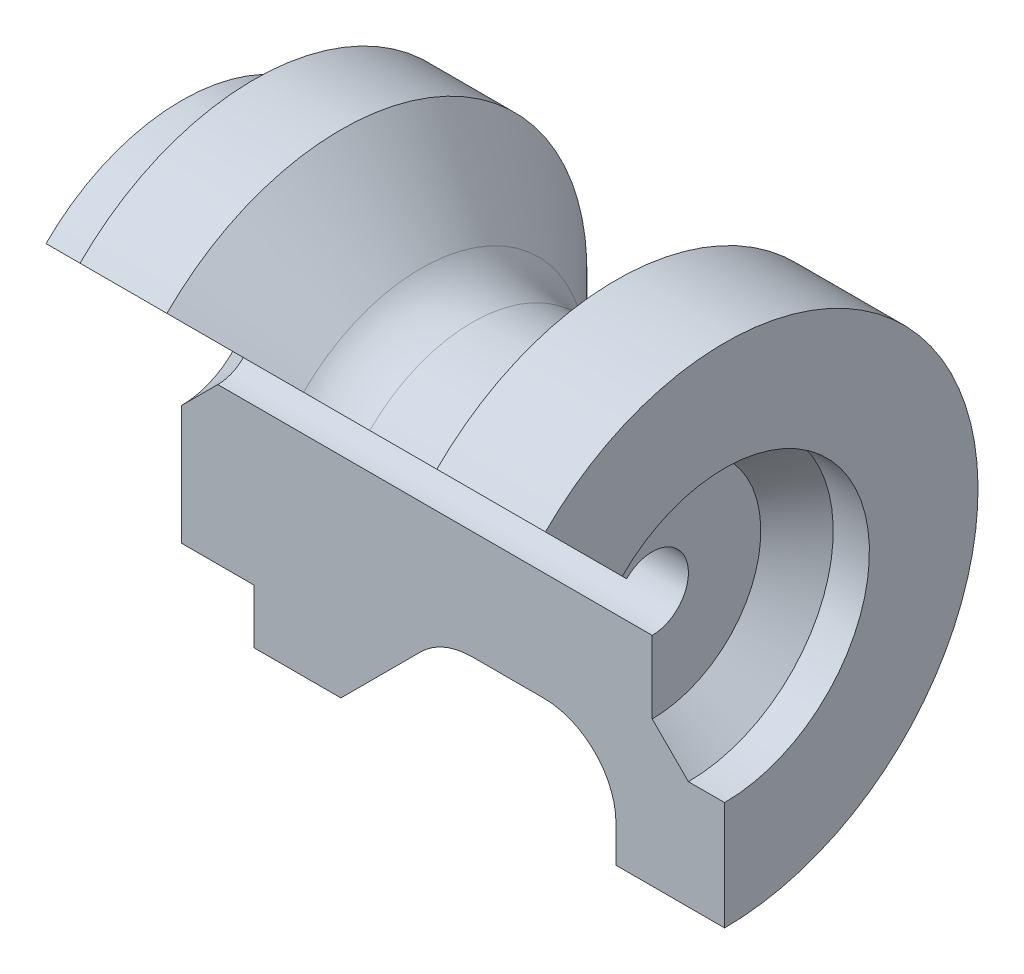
ISO-10303-21;
HEADER;
FILE_DESCRIPTION(('STEP AP214'),'2;1');
FILE_NAME('part.step','',(''),(''),'','','');
FILE_SCHEMA(('AUTOMOTIVE_DESIGN { 1 0 10303 214 1 1 1 1 }'));
ENDSEC;
DATA;
#1=APPLICATION_CONTEXT('core data for automotive mechanical design processes');
#2=APPLICATION_PROTOCOL_DEFINITION('international standard','automotive_design',2000,#1);
#3=PRODUCT_CONTEXT('',#1,'mechanical');
#4=PRODUCT('Part','Part','',(#3));
#5=PRODUCT_RELATED_PRODUCT_CATEGORY('part','',(#4));
#6=PRODUCT_DEFINITION_FORMATION('','',#4);
#7=PRODUCT_DEFINITION_CONTEXT('part definition',#1,'design');
#8=PRODUCT_DEFINITION('design','',#6,#7);
#9=PRODUCT_DEFINITION_SHAPE('','',#8);
#10=(LENGTH_UNIT() NAMED_UNIT(*) SI_UNIT(.MILLI.,.METRE.));
#11=(NAMED_UNIT(*) PLANE_ANGLE_UNIT() SI_UNIT($,.RADIAN.));
#12=(NAMED_UNIT(*) SI_UNIT($,.STERADIAN.) SOLID_ANGLE_UNIT());
#13=UNCERTAINTY_MEASURE_WITH_UNIT(LENGTH_MEASURE(1.E-05),#10,'distance_accuracy_value','');
#14=(GEOMETRIC_REPRESENTATION_CONTEXT(3) GLOBAL_UNCERTAINTY_ASSIGNED_CONTEXT((#13)) GLOBAL_UNIT_ASSIGNED_CONTEXT((#10,
#11,#12)) REPRESENTATION_CONTEXT('',''));
#15=CARTESIAN_POINT('',(0.,0.,0.));
#16=DIRECTION('',(0.,0.,1.));
#17=DIRECTION('',(1.,0.,0.));
#18=AXIS2_PLACEMENT_3D('',#15,#16,#17);
#19=CARTESIAN_POINT('',(0.,0.,0.));
#20=DIRECTION('',(1.,0.,0.));
#21=DIRECTION('',(0.,0.,-1.));
#22=AXIS2_PLACEMENT_3D('',#19,#20,#21);
#23=CYLINDRICAL_SURFACE('',#22,5.);
#24=CARTESIAN_POINT('',(65.,0.,0.));
#25=DIRECTION('',(1.,0.,0.));
#26=DIRECTION('',(0.,0.,-1.));
#27=AXIS2_PLACEMENT_3D('',#24,#25,#26);
#28=CIRCLE('',#27,5.);
#29=CARTESIAN_POINT('',(65.,-5.,0.));
#30=VERTEX_POINT('',#29);
#31=CARTESIAN_POINT('',(65.,3.53553390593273,3.53553390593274));
#32=VERTEX_POINT('',#31);
#33=EDGE_CURVE('E11',#30,#32,#28,.T.);
#34=ORIENTED_EDGE('',*,*,#33,.T.);
#35=DIRECTION('',(1.,0.,0.));
#36=VECTOR('',#35,1.);
#37=CARTESIAN_POINT('',(65.,3.53553390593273,3.53553390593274));
#38=LINE('',#37,#36);
#39=CARTESIAN_POINT('',(5.,3.53553390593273,3.53553390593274));
#40=VERTEX_POINT('',#39);
#41=EDGE_CURVE('E143',#40,#32,#38,.T.);
#42=ORIENTED_EDGE('',*,*,#41,.F.);
#43=CARTESIAN_POINT('',(5.,0.,0.));
#44=DIRECTION('',(1.,0.,0.));
#45=DIRECTION('',(0.,0.,-1.));
#46=AXIS2_PLACEMENT_3D('',#43,#44,#45);
#47=CIRCLE('',#46,4.99999999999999);
#48=CARTESIAN_POINT('',(5.,-4.99999999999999,0.));
#49=VERTEX_POINT('',#48);
#50=EDGE_CURVE('E46',#49,#40,#47,.T.);
#51=ORIENTED_EDGE('',*,*,#50,.F.);
#52=DIRECTION('',(1.,0.,0.));
#53=VECTOR('',#52,1.);
#54=CARTESIAN_POINT('',(65.,-5.,0.));
#55=LINE('',#54,#53);
#56=EDGE_CURVE('E145',#49,#30,#55,.T.);
#57=ORIENTED_EDGE('',*,*,#56,.T.);
#58=EDGE_LOOP('',(#34,#42,#51,#57));
#59=FACE_BOUND('',#58,.T.);
#60=ADVANCED_FACE('F31',(#59),#23,.F.);
#61=CARTESIAN_POINT('',(65.,-15.,1.0321604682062E-13));
#62=DIRECTION('',(1.,0.,0.));
#63=DIRECTION('',(0.,0.,-1.));
#64=AXIS2_PLACEMENT_3D('',#61,#62,#63);
#65=PLANE('',#64);
#66=CARTESIAN_POINT('',(65.,0.,0.));
#67=DIRECTION('',(1.,0.,0.));
#68=DIRECTION('',(0.,0.,-1.));
#69=AXIS2_PLACEMENT_3D('',#66,#67,#68);
#70=CIRCLE('',#69,15.);
#71=CARTESIAN_POINT('',(65.,-15.,1.0321604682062E-13));
#72=VERTEX_POINT('',#71);
#73=CARTESIAN_POINT('',(65.,10.6066017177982,10.6066017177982));
#74=VERTEX_POINT('',#73);
#75=EDGE_CURVE('E39',#72,#74,#70,.T.);
#76=ORIENTED_EDGE('',*,*,#75,.T.);
#77=DIRECTION('',(0.,0.707106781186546,0.707106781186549));
#78=VECTOR('',#77,1.);
#79=CARTESIAN_POINT('',(65.,10.6066017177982,10.6066017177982));
#80=LINE('',#79,#78);
#81=EDGE_CURVE('E154',#32,#74,#80,.T.);
#82=ORIENTED_EDGE('',*,*,#81,.F.);
#83=ORIENTED_EDGE('',*,*,#33,.F.);
#84=DIRECTION('',(0.,-1.,0.));
#85=VECTOR('',#84,1.);
#86=CARTESIAN_POINT('',(65.,-15.,1.0321604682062E-13));
#87=LINE('',#86,#85);
#88=EDGE_CURVE('E200',#30,#72,#87,.T.);
#89=ORIENTED_EDGE('',*,*,#88,.T.);
#90=EDGE_LOOP('',(#76,#82,#83,#89));
#91=FACE_BOUND('',#90,.T.);
#92=ADVANCED_FACE('F33',(#91),#65,.T.);
#93=CARTESIAN_POINT('',(65.,0.,0.));
#94=DIRECTION('',(1.,0.,0.));
#95=DIRECTION('',(0.,0.,-1.));
#96=AXIS2_PLACEMENT_3D('',#93,#94,#95);
#97=CONICAL_SURFACE('',#96,15.,0.785398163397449);
#98=CARTESIAN_POINT('',(70.,0.,0.));
#99=DIRECTION('',(1.,0.,0.));
#100=DIRECTION('',(0.,0.,-1.));
#101=AXIS2_PLACEMENT_3D('',#98,#99,#100);
#102=CIRCLE('',#101,20.);
#103=CARTESIAN_POINT('',(70.,-20.,1.38777878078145E-13));
#104=VERTEX_POINT('',#103);
#105=CARTESIAN_POINT('',(70.,14.1421356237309,14.142135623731));
#106=VERTEX_POINT('',#105);
#107=EDGE_CURVE('E266',#104,#106,#102,.T.);
#108=ORIENTED_EDGE('',*,*,#107,.T.);
#109=DIRECTION('',(0.707106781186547,0.499999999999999,0.500000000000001));
#110=VECTOR('',#109,1.);
#111=CARTESIAN_POINT('',(70.,14.1421356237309,14.142135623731));
#112=LINE('',#111,#110);
#113=EDGE_CURVE('E159',#74,#106,#112,.T.);
#114=ORIENTED_EDGE('',*,*,#113,.F.);
#115=ORIENTED_EDGE('',*,*,#75,.F.);
#116=DIRECTION('',(0.707106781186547,-0.707106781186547,0.));
#117=VECTOR('',#116,1.);
#118=CARTESIAN_POINT('',(70.,-20.,1.38777878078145E-13));
#119=LINE('',#118,#117);
#120=EDGE_CURVE('E202',#72,#104,#119,.T.);
#121=ORIENTED_EDGE('',*,*,#120,.T.);
#122=EDGE_LOOP('',(#108,#114,#115,#121));
#123=FACE_BOUND('',#122,.T.);
#124=ADVANCED_FACE('F268',(#123),#97,.F.);
#125=CARTESIAN_POINT('',(0.,0.,0.));
#126=DIRECTION('',(1.,0.,0.));
#127=DIRECTION('',(0.,0.,-1.));
#128=AXIS2_PLACEMENT_3D('',#125,#126,#127);
#129=CYLINDRICAL_SURFACE('',#128,20.);
#130=CARTESIAN_POINT('',(75.,0.,0.));
#131=DIRECTION('',(1.,0.,0.));
#132=DIRECTION('',(0.,0.,-1.));
#133=AXIS2_PLACEMENT_3D('',#130,#131,#132);
#134=CIRCLE('',#133,20.);
#135=CARTESIAN_POINT('',(75.,-20.,1.38777878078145E-13));
#136=VERTEX_POINT('',#135);
#137=CARTESIAN_POINT('',(75.,14.1421356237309,14.142135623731));
#138=VERTEX_POINT('',#137);
#139=EDGE_CURVE('E264',#136,#138,#134,.T.);
#140=ORIENTED_EDGE('',*,*,#139,.T.);
#141=DIRECTION('',(1.,0.,0.));
#142=VECTOR('',#141,1.);
#143=CARTESIAN_POINT('',(75.,14.1421356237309,14.142135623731));
#144=LINE('',#143,#142);
#145=EDGE_CURVE('E161',#106,#138,#144,.T.);
#146=ORIENTED_EDGE('',*,*,#145,.F.);
#147=ORIENTED_EDGE('',*,*,#107,.F.);
#148=DIRECTION('',(1.,0.,0.));
#149=VECTOR('',#148,1.);
#150=CARTESIAN_POINT('',(75.,-20.,1.38777878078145E-13));
#151=LINE('',#150,#149);
#152=EDGE_CURVE('E205',#104,#136,#151,.T.);
#153=ORIENTED_EDGE('',*,*,#152,.T.);
#154=EDGE_LOOP('',(#140,#146,#147,#153));
#155=FACE_BOUND('',#154,.T.);
#156=ADVANCED_FACE('F274',(#155),#129,.F.);
#157=CARTESIAN_POINT('',(75.,-35.,2.42861286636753E-13));
#158=DIRECTION('',(1.,0.,0.));
#159=DIRECTION('',(0.,0.,-1.));
#160=AXIS2_PLACEMENT_3D('',#157,#158,#159);
#161=PLANE('',#160);
#162=CARTESIAN_POINT('',(75.,0.,0.));
#163=DIRECTION('',(1.,0.,0.));
#164=DIRECTION('',(0.,0.,-1.));
#165=AXIS2_PLACEMENT_3D('',#162,#163,#164);
#166=CIRCLE('',#165,35.);
#167=CARTESIAN_POINT('',(75.,-35.,2.42861286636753E-13));
#168=VERTEX_POINT('',#167);
#169=CARTESIAN_POINT('',(75.,24.7487373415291,24.7487373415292));
#170=VERTEX_POINT('',#169);
#171=EDGE_CURVE('E262',#168,#170,#166,.T.);
#172=ORIENTED_EDGE('',*,*,#171,.T.);
#173=DIRECTION('',(0.,0.707106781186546,0.707106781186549));
#174=VECTOR('',#173,1.);
#175=CARTESIAN_POINT('',(75.,24.7487373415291,24.7487373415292));
#176=LINE('',#175,#174);
#177=EDGE_CURVE('E166',#138,#170,#176,.T.);
#178=ORIENTED_EDGE('',*,*,#177,.F.);
#179=ORIENTED_EDGE('',*,*,#139,.F.);
#180=DIRECTION('',(0.,-1.,0.));
#181=VECTOR('',#180,1.);
#182=CARTESIAN_POINT('',(75.,-35.,2.42861286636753E-13));
#183=LINE('',#182,#181);
#184=EDGE_CURVE('E208',#136,#168,#183,.T.);
#185=ORIENTED_EDGE('',*,*,#184,.T.);
#186=EDGE_LOOP('',(#172,#178,#179,#185));
#187=FACE_BOUND('',#186,.T.);
#188=ADVANCED_FACE('F277',(#187),#161,.T.);
#189=CARTESIAN_POINT('',(0.,0.,0.));
#190=DIRECTION('',(1.,0.,0.));
#191=DIRECTION('',(0.,0.,-1.));
#192=AXIS2_PLACEMENT_3D('',#189,#190,#191);
#193=CYLINDRICAL_SURFACE('',#192,35.);
#194=CARTESIAN_POINT('',(60.,0.,0.));
#195=DIRECTION('',(1.,0.,0.));
#196=DIRECTION('',(0.,0.,-1.));
#197=AXIS2_PLACEMENT_3D('',#194,#195,#196);
#198=CIRCLE('',#197,35.);
#199=CARTESIAN_POINT('',(60.,-35.,2.42861286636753E-13));
#200=VERTEX_POINT('',#199);
#201=CARTESIAN_POINT('',(60.,24.7487373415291,24.7487373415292));
#202=VERTEX_POINT('',#201);
#203=EDGE_CURVE('E260',#200,#202,#198,.T.);
#204=ORIENTED_EDGE('',*,*,#203,.T.);
#205=DIRECTION('',(-1.,0.,0.));
#206=VECTOR('',#205,1.);
#207=CARTESIAN_POINT('',(60.,24.7487373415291,24.7487373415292));
#208=LINE('',#207,#206);
#209=EDGE_CURVE('E169',#170,#202,#208,.T.);
#210=ORIENTED_EDGE('',*,*,#209,.F.);
#211=ORIENTED_EDGE('',*,*,#171,.F.);
#212=DIRECTION('',(-1.,0.,0.));
#213=VECTOR('',#212,1.);
#214=CARTESIAN_POINT('',(60.,-35.,2.42861286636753E-13));
#215=LINE('',#214,#213);
#216=EDGE_CURVE('E211',#168,#200,#215,.T.);
#217=ORIENTED_EDGE('',*,*,#216,.T.);
#218=EDGE_LOOP('',(#204,#210,#211,#217));
#219=FACE_BOUND('',#218,.T.);
#220=ADVANCED_FACE('F282',(#219),#193,.T.);
#221=CARTESIAN_POINT('',(60.,-30.,2.0643209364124E-13));
#222=DIRECTION('',(-1.,0.,0.));
#223=DIRECTION('',(0.,0.,1.));
#224=AXIS2_PLACEMENT_3D('',#221,#222,#223);
#225=PLANE('',#224);
#226=CARTESIAN_POINT('',(60.,0.,0.));
#227=DIRECTION('',(1.,0.,0.));
#228=DIRECTION('',(0.,0.,-1.));
#229=AXIS2_PLACEMENT_3D('',#226,#227,#228);
#230=CIRCLE('',#229,30.);
#231=CARTESIAN_POINT('',(60.,-30.,2.0643209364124E-13));
#232=VERTEX_POINT('',#231);
#233=CARTESIAN_POINT('',(60.,21.2132034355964,21.2132034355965));
#234=VERTEX_POINT('',#233);
#235=EDGE_CURVE('E258',#232,#234,#230,.T.);
#236=ORIENTED_EDGE('',*,*,#235,.T.);
#237=DIRECTION('',(0.,-0.707106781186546,-0.707106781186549));
#238=VECTOR('',#237,1.);
#239=CARTESIAN_POINT('',(60.,21.2132034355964,21.2132034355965));
#240=LINE('',#239,#238);
#241=EDGE_CURVE('E172',#202,#234,#240,.T.);
#242=ORIENTED_EDGE('',*,*,#241,.F.);
#243=ORIENTED_EDGE('',*,*,#203,.F.);
#244=DIRECTION('',(0.,1.,0.));
#245=VECTOR('',#244,1.);
#246=CARTESIAN_POINT('',(60.,-30.,2.0643209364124E-13));
#247=LINE('',#246,#245);
#248=EDGE_CURVE('E214',#200,#232,#247,.T.);
#249=ORIENTED_EDGE('',*,*,#248,.T.);
#250=EDGE_LOOP('',(#236,#242,#243,#249));
#251=FACE_BOUND('',#250,.T.);
#252=ADVANCED_FACE('F285',(#251),#225,.T.);
#253=CARTESIAN_POINT('',(50.,0.,0.));
#254=DIRECTION('',(1.,0.,0.));
#255=DIRECTION('',(0.,0.,-1.));
#256=AXIS2_PLACEMENT_3D('',#253,#254,#255);
#257=TOROIDAL_SURFACE('',#256,30.,10.);
#258=CARTESIAN_POINT('',(50.,0.,0.));
#259=DIRECTION('',(1.,0.,0.));
#260=DIRECTION('',(0.,0.,-1.));
#261=AXIS2_PLACEMENT_3D('',#258,#259,#260);
#262=CIRCLE('',#261,20.);
#263=CARTESIAN_POINT('',(50.,-20.,1.38777878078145E-13));
#264=VERTEX_POINT('',#263);
#265=CARTESIAN_POINT('',(50.,14.1421356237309,14.142135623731));
#266=VERTEX_POINT('',#265);
#267=EDGE_CURVE('E256',#264,#266,#262,.T.);
#268=ORIENTED_EDGE('',*,*,#267,.T.);
#269=CARTESIAN_POINT('',(50.,21.2132034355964,21.2132034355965));
#270=DIRECTION('',(0.,0.707106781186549,-0.707106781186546));
#271=DIRECTION('',(1.,0.,0.));
#272=AXIS2_PLACEMENT_3D('',#269,#270,#271);
#273=CIRCLE('',#272,10.);
#274=EDGE_CURVE('E175',#234,#266,#273,.T.);
#275=ORIENTED_EDGE('',*,*,#274,.F.);
#276=ORIENTED_EDGE('',*,*,#235,.F.);
#277=CARTESIAN_POINT('',(50.,-30.,2.0643209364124E-13));
#278=DIRECTION('',(0.,0.,1.));
#279=DIRECTION('',(1.,0.,0.));
#280=AXIS2_PLACEMENT_3D('',#277,#278,#279);
#281=CIRCLE('',#280,10.);
#282=EDGE_CURVE('E217',#232,#264,#281,.T.);
#283=ORIENTED_EDGE('',*,*,#282,.T.);
#284=EDGE_LOOP('',(#268,#275,#276,#283));
#285=FACE_BOUND('',#284,.T.);
#286=ADVANCED_FACE('F290',(#285),#257,.F.);
#287=CARTESIAN_POINT('',(0.,0.,0.));
#288=DIRECTION('',(1.,0.,0.));
#289=DIRECTION('',(0.,0.,-1.));
#290=AXIS2_PLACEMENT_3D('',#287,#288,#289);
#291=CYLINDRICAL_SURFACE('',#290,20.);
#292=CARTESIAN_POINT('',(40.1290893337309,0.,0.));
#293=DIRECTION('',(1.,0.,0.));
#294=DIRECTION('',(0.,0.,-1.));
#295=AXIS2_PLACEMENT_3D('',#292,#293,#294);
#296=CIRCLE('',#295,20.);
#297=CARTESIAN_POINT('',(40.1290893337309,-20.,1.38777878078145E-13));
#298=VERTEX_POINT('',#297);
#299=CARTESIAN_POINT('',(40.1290893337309,14.1421356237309,14.142135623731));
#300=VERTEX_POINT('',#299);
#301=EDGE_CURVE('E254',#298,#300,#296,.T.);
#302=ORIENTED_EDGE('',*,*,#301,.T.);
#303=DIRECTION('',(-1.,0.,0.));
#304=VECTOR('',#303,1.);
#305=CARTESIAN_POINT('',(40.1290893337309,14.1421356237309,14.142135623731));
#306=LINE('',#305,#304);
#307=EDGE_CURVE('E178',#266,#300,#306,.T.);
#308=ORIENTED_EDGE('',*,*,#307,.F.);
#309=ORIENTED_EDGE('',*,*,#267,.F.);
#310=DIRECTION('',(-1.,0.,0.));
#311=VECTOR('',#310,1.);
#312=CARTESIAN_POINT('',(40.1290893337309,-20.,1.38777878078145E-13));
#313=LINE('',#312,#311);
#314=EDGE_CURVE('E220',#264,#298,#313,.T.);
#315=ORIENTED_EDGE('',*,*,#314,.T.);
#316=EDGE_LOOP('',(#302,#308,#309,#315));
#317=FACE_BOUND('',#316,.T.);
#318=ADVANCED_FACE('F293',(#317),#291,.T.);
#319=CARTESIAN_POINT('',(40.1290893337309,0.,0.));
#320=DIRECTION('',(1.,0.,0.));
#321=DIRECTION('',(0.,0.,-1.));
#322=AXIS2_PLACEMENT_3D('',#319,#320,#321);
#323=TOROIDAL_SURFACE('',#322,30.,10.);
#324=CARTESIAN_POINT('',(33.0580215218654,0.,0.));
#325=DIRECTION('',(1.,0.,0.));
#326=DIRECTION('',(0.,0.,-1.));
#327=AXIS2_PLACEMENT_3D('',#324,#325,#326);
#328=CIRCLE('',#327,22.9289321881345);
#329=CARTESIAN_POINT('',(33.0580215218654,-22.9289321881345,1.57859836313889E-13));
#330=VERTEX_POINT('',#329);
#331=CARTESIAN_POINT('',(33.0580215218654,16.2132034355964,16.2132034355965));
#332=VERTEX_POINT('',#331);
#333=EDGE_CURVE('E252',#330,#332,#328,.T.);
#334=ORIENTED_EDGE('',*,*,#333,.T.);
#335=CARTESIAN_POINT('',(40.1290893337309,21.2132034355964,21.2132034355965));
#336=DIRECTION('',(0.,0.707106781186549,-0.707106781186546));
#337=DIRECTION('',(1.,0.,0.));
#338=AXIS2_PLACEMENT_3D('',#335,#336,#337);
#339=CIRCLE('',#338,10.);
#340=EDGE_CURVE('E181',#300,#332,#339,.T.);
#341=ORIENTED_EDGE('',*,*,#340,.F.);
#342=ORIENTED_EDGE('',*,*,#301,.F.);
#343=CARTESIAN_POINT('',(40.1290893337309,-30.,2.0643209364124E-13));
#344=DIRECTION('',(0.,0.,1.));
#345=DIRECTION('',(1.,0.,0.));
#346=AXIS2_PLACEMENT_3D('',#343,#344,#345);
#347=CIRCLE('',#346,10.);
#348=EDGE_CURVE('E223',#298,#330,#347,.T.);
#349=ORIENTED_EDGE('',*,*,#348,.T.);
#350=EDGE_LOOP('',(#334,#341,#342,#349));
#351=FACE_BOUND('',#350,.T.);
#352=ADVANCED_FACE('F298',(#351),#323,.F.);
#353=CARTESIAN_POINT('',(33.0580215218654,0.,0.));
#354=DIRECTION('',(-1.,0.,0.));
#355=DIRECTION('',(0.,0.,1.));
#356=AXIS2_PLACEMENT_3D('',#353,#354,#355);
#357=CONICAL_SURFACE('',#356,22.9289321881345,0.78539816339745);
#358=CARTESIAN_POINT('',(22.,0.,0.));
#359=DIRECTION('',(1.,0.,0.));
#360=DIRECTION('',(0.,0.,-1.));
#361=AXIS2_PLACEMENT_3D('',#358,#359,#360);
#362=CIRCLE('',#361,33.98695371);
#363=CARTESIAN_POINT('',(22.,-33.98695371,2.32452945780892E-13));
#364=VERTEX_POINT('',#363);
#365=CARTESIAN_POINT('',(22.,24.0324054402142,24.0324054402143));
#366=VERTEX_POINT('',#365);
#367=EDGE_CURVE('E250',#364,#366,#362,.T.);
#368=ORIENTED_EDGE('',*,*,#367,.T.);
#369=DIRECTION('',(-0.707106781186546,0.5,0.500000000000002));
#370=VECTOR('',#369,1.);
#371=CARTESIAN_POINT('',(22.,24.0324054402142,24.0324054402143));
#372=LINE('',#371,#370);
#373=EDGE_CURVE('E184',#332,#366,#372,.T.);
#374=ORIENTED_EDGE('',*,*,#373,.F.);
#375=ORIENTED_EDGE('',*,*,#333,.F.);
#376=DIRECTION('',(-0.707106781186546,-0.707106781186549,0.));
#377=VECTOR('',#376,1.);
#378=CARTESIAN_POINT('',(22.,-33.98695371,2.32452945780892E-13));
#379=LINE('',#378,#377);
#380=EDGE_CURVE('E226',#330,#364,#379,.T.);
#381=ORIENTED_EDGE('',*,*,#380,.T.);
#382=EDGE_LOOP('',(#368,#374,#375,#381));
#383=FACE_BOUND('',#382,.T.);
#384=ADVANCED_FACE('F301',(#383),#357,.T.);
#385=CARTESIAN_POINT('',(0.,0.,0.));
#386=DIRECTION('',(1.,0.,0.));
#387=DIRECTION('',(0.,0.,-1.));
#388=AXIS2_PLACEMENT_3D('',#385,#386,#387);
#389=CYLINDRICAL_SURFACE('',#388,33.98695371);
#390=CARTESIAN_POINT('',(10.,0.,0.));
#391=DIRECTION('',(1.,0.,0.));
#392=DIRECTION('',(0.,0.,-1.));
#393=AXIS2_PLACEMENT_3D('',#390,#391,#392);
#394=CIRCLE('',#393,33.98695371);
#395=CARTESIAN_POINT('',(10.,-33.98695371,2.32452945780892E-13));
#396=VERTEX_POINT('',#395);
#397=CARTESIAN_POINT('',(10.,24.0324054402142,24.0324054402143));
#398=VERTEX_POINT('',#397);
#399=EDGE_CURVE('E248',#396,#398,#394,.T.);
#400=ORIENTED_EDGE('',*,*,#399,.T.);
#401=DIRECTION('',(-1.,0.,0.));
#402=VECTOR('',#401,1.);
#403=CARTESIAN_POINT('',(10.,24.0324054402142,24.0324054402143));
#404=LINE('',#403,#402);
#405=EDGE_CURVE('E187',#366,#398,#404,.T.);
#406=ORIENTED_EDGE('',*,*,#405,.F.);
#407=ORIENTED_EDGE('',*,*,#367,.F.);
#408=DIRECTION('',(-1.,0.,0.));
#409=VECTOR('',#408,1.);
#410=CARTESIAN_POINT('',(10.,-33.98695371,2.32452945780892E-13));
#411=LINE('',#410,#409);
#412=EDGE_CURVE('E229',#364,#396,#411,.T.);
#413=ORIENTED_EDGE('',*,*,#412,.T.);
#414=EDGE_LOOP('',(#400,#406,#407,#413));
#415=FACE_BOUND('',#414,.T.);
#416=ADVANCED_FACE('F306',(#415),#389,.T.);
#417=CARTESIAN_POINT('',(10.,-26.48575559,1.83880688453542E-13));
#418=DIRECTION('',(-1.,0.,0.));
#419=DIRECTION('',(0.,0.,1.));
#420=AXIS2_PLACEMENT_3D('',#417,#418,#419);
#421=PLANE('',#420);
#422=CARTESIAN_POINT('',(10.,0.,0.));
#423=DIRECTION('',(1.,0.,0.));
#424=DIRECTION('',(0.,0.,-1.));
#425=AXIS2_PLACEMENT_3D('',#422,#423,#424);
#426=CIRCLE('',#425,26.48575559);
#427=CARTESIAN_POINT('',(10.,-26.48575559,1.83880688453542E-13));
#428=VERTEX_POINT('',#427);
#429=CARTESIAN_POINT('',(10.,18.7282573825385,18.7282573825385));
#430=VERTEX_POINT('',#429);
#431=EDGE_CURVE('E246',#428,#430,#426,.T.);
#432=ORIENTED_EDGE('',*,*,#431,.T.);
#433=DIRECTION('',(0.,-0.707106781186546,-0.707106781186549));
#434=VECTOR('',#433,1.);
#435=CARTESIAN_POINT('',(10.,18.7282573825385,18.7282573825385));
#436=LINE('',#435,#434);
#437=EDGE_CURVE('E190',#398,#430,#436,.T.);
#438=ORIENTED_EDGE('',*,*,#437,.F.);
#439=ORIENTED_EDGE('',*,*,#399,.F.);
#440=DIRECTION('',(0.,1.,0.));
#441=VECTOR('',#440,1.);
#442=CARTESIAN_POINT('',(10.,-26.48575559,1.83880688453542E-13));
#443=LINE('',#442,#441);
#444=EDGE_CURVE('E232',#396,#428,#443,.T.);
#445=ORIENTED_EDGE('',*,*,#444,.T.);
#446=EDGE_LOOP('',(#432,#438,#439,#445));
#447=FACE_BOUND('',#446,.T.);
#448=ADVANCED_FACE('F309',(#447),#421,.T.);
#449=CARTESIAN_POINT('',(0.,0.,0.));
#450=DIRECTION('',(1.,0.,0.));
#451=DIRECTION('',(0.,0.,-1.));
#452=AXIS2_PLACEMENT_3D('',#449,#450,#451);
#453=CYLINDRICAL_SURFACE('',#452,26.48575559);
#454=CARTESIAN_POINT('',(0.,0.,0.));
#455=DIRECTION('',(1.,0.,0.));
#456=DIRECTION('',(0.,0.,-1.));
#457=AXIS2_PLACEMENT_3D('',#454,#455,#456);
#458=CIRCLE('',#457,26.48575559);
#459=CARTESIAN_POINT('',(0.,-26.48575559,1.83880688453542E-13));
#460=VERTEX_POINT('',#459);
#461=CARTESIAN_POINT('',(0.,18.7282573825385,18.7282573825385));
#462=VERTEX_POINT('',#461);
#463=EDGE_CURVE('E244',#460,#462,#458,.T.);
#464=ORIENTED_EDGE('',*,*,#463,.T.);
#465=DIRECTION('',(-1.,0.,0.));
#466=VECTOR('',#465,1.);
#467=CARTESIAN_POINT('',(0.,18.7282573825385,18.7282573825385));
#468=LINE('',#467,#466);
#469=EDGE_CURVE('E193',#430,#462,#468,.T.);
#470=ORIENTED_EDGE('',*,*,#469,.F.);
#471=ORIENTED_EDGE('',*,*,#431,.F.);
#472=DIRECTION('',(-1.,0.,0.));
#473=VECTOR('',#472,1.);
#474=CARTESIAN_POINT('',(0.,-26.48575559,1.83880688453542E-13));
#475=LINE('',#474,#473);
#476=EDGE_CURVE('E235',#428,#460,#475,.T.);
#477=ORIENTED_EDGE('',*,*,#476,.T.);
#478=EDGE_LOOP('',(#464,#470,#471,#477));
#479=FACE_BOUND('',#478,.T.);
#480=ADVANCED_FACE('F314',(#479),#453,.T.);
#481=CARTESIAN_POINT('',(0.,-10.,0.));
#482=DIRECTION('',(-1.,0.,0.));
#483=DIRECTION('',(0.,0.,1.));
#484=AXIS2_PLACEMENT_3D('',#481,#482,#483);
#485=PLANE('',#484);
#486=CARTESIAN_POINT('',(0.,0.,0.));
#487=DIRECTION('',(1.,0.,0.));
#488=DIRECTION('',(0.,0.,-1.));
#489=AXIS2_PLACEMENT_3D('',#486,#487,#488);
#490=CIRCLE('',#489,10.);
#491=CARTESIAN_POINT('',(0.,-10.,0.));
#492=VERTEX_POINT('',#491);
#493=CARTESIAN_POINT('',(0.,7.07106781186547,7.0710678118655));
#494=VERTEX_POINT('',#493);
#495=EDGE_CURVE('E54',#492,#494,#490,.T.);
#496=ORIENTED_EDGE('',*,*,#495,.T.);
#497=DIRECTION('',(0.,-0.707106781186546,-0.707106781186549));
#498=VECTOR('',#497,1.);
#499=CARTESIAN_POINT('',(0.,7.07106781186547,7.0710678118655));
#500=LINE('',#499,#498);
#501=EDGE_CURVE('E196',#462,#494,#500,.T.);
#502=ORIENTED_EDGE('',*,*,#501,.F.);
#503=ORIENTED_EDGE('',*,*,#463,.F.);
#504=DIRECTION('',(0.,1.,0.));
#505=VECTOR('',#504,1.);
#506=CARTESIAN_POINT('',(0.,-10.,0.));
#507=LINE('',#506,#505);
#508=EDGE_CURVE('E238',#460,#492,#507,.T.);
#509=ORIENTED_EDGE('',*,*,#508,.T.);
#510=EDGE_LOOP('',(#496,#502,#503,#509));
#511=FACE_BOUND('',#510,.T.);
#512=ADVANCED_FACE('F317',(#511),#485,.T.);
#513=CARTESIAN_POINT('',(0.,0.,0.));
#514=DIRECTION('',(-1.,0.,0.));
#515=DIRECTION('',(0.,0.,1.));
#516=AXIS2_PLACEMENT_3D('',#513,#514,#515);
#517=CONICAL_SURFACE('',#516,10.,0.78539816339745);
#518=DIRECTION('',(0.707106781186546,0.707106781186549,0.));
#519=VECTOR('',#518,1.);
#520=CARTESIAN_POINT('',(5.,-4.99999999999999,0.));
#521=LINE('',#520,#519);
#522=EDGE_CURVE('E240',#492,#49,#521,.T.);
#523=ORIENTED_EDGE('',*,*,#522,.T.);
#524=ORIENTED_EDGE('',*,*,#50,.T.);
#525=DIRECTION('',(0.707106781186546,-0.5,-0.500000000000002));
#526=VECTOR('',#525,1.);
#527=CARTESIAN_POINT('',(5.,3.53553390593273,3.53553390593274));
#528=LINE('',#527,#526);
#529=EDGE_CURVE('E157',#494,#40,#528,.T.);
#530=ORIENTED_EDGE('',*,*,#529,.F.);
#531=ORIENTED_EDGE('',*,*,#495,.F.);
#532=EDGE_LOOP('',(#523,#524,#530,#531));
#533=FACE_BOUND('',#532,.T.);
#534=ADVANCED_FACE('F319',(#533),#517,.F.);
#535=CARTESIAN_POINT('',(40.1290893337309,-30.,2.0643209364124E-13));
#536=DIRECTION('',(0.,0.,-1.));
#537=DIRECTION('',(1.,0.,0.));
#538=AXIS2_PLACEMENT_3D('',#535,#536,#537);
#539=PLANE('',#538);
#540=ORIENTED_EDGE('',*,*,#56,.F.);
#541=ORIENTED_EDGE('',*,*,#522,.F.);
#542=ORIENTED_EDGE('',*,*,#508,.F.);
#543=ORIENTED_EDGE('',*,*,#476,.F.);
#544=ORIENTED_EDGE('',*,*,#444,.F.);
#545=ORIENTED_EDGE('',*,*,#412,.F.);
#546=ORIENTED_EDGE('',*,*,#380,.F.);
#547=ORIENTED_EDGE('',*,*,#348,.F.);
#548=ORIENTED_EDGE('',*,*,#314,.F.);
#549=ORIENTED_EDGE('',*,*,#282,.F.);
#550=ORIENTED_EDGE('',*,*,#248,.F.);
#551=ORIENTED_EDGE('',*,*,#216,.F.);
#552=ORIENTED_EDGE('',*,*,#184,.F.);
#553=ORIENTED_EDGE('',*,*,#152,.F.);
#554=ORIENTED_EDGE('',*,*,#120,.F.);
#555=ORIENTED_EDGE('',*,*,#88,.F.);
#556=EDGE_LOOP('',(#540,#541,#542,#543,#544,#545,#546,#547,#548,#549,#550,#551,#552,#553,#554,#555));
#557=FACE_BOUND('',#556,.T.);
#558=ADVANCED_FACE('F321',(#557),#539,.F.);
#559=CARTESIAN_POINT('',(40.1290893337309,21.2132034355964,21.2132034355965));
#560=DIRECTION('',(0.,-0.707106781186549,0.707106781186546));
#561=DIRECTION('',(1.,0.,0.));
#562=AXIS2_PLACEMENT_3D('',#559,#560,#561);
#563=PLANE('',#562);
#564=ORIENTED_EDGE('',*,*,#41,.T.);
#565=ORIENTED_EDGE('',*,*,#81,.T.);
#566=ORIENTED_EDGE('',*,*,#113,.T.);
#567=ORIENTED_EDGE('',*,*,#145,.T.);
#568=ORIENTED_EDGE('',*,*,#177,.T.);
#569=ORIENTED_EDGE('',*,*,#209,.T.);
#570=ORIENTED_EDGE('',*,*,#241,.T.);
#571=ORIENTED_EDGE('',*,*,#274,.T.);
#572=ORIENTED_EDGE('',*,*,#307,.T.);
#573=ORIENTED_EDGE('',*,*,#340,.T.);
#574=ORIENTED_EDGE('',*,*,#373,.T.);
#575=ORIENTED_EDGE('',*,*,#405,.T.);
#576=ORIENTED_EDGE('',*,*,#437,.T.);
#577=ORIENTED_EDGE('',*,*,#469,.T.);
#578=ORIENTED_EDGE('',*,*,#501,.T.);
#579=ORIENTED_EDGE('',*,*,#529,.T.);
#580=EDGE_LOOP('',(#564,#565,#566,#567,#568,#569,#570,#571,#572,#573,#574,#575,#576,#577,#578,#579));
#581=FACE_BOUND('',#580,.T.);
#582=ADVANCED_FACE('F152',(#581),#563,.T.);
#583=CLOSED_SHELL('',(#60,#92,#124,#156,#188,#220,#252,#286,#318,#352,#384,#416,#448,#480,#512,
#534,#558,#582));
#584=MANIFOLD_SOLID_BREP('B2',#583);
#585=ADVANCED_BREP_SHAPE_REPRESENTATION('',(#18,#584),#14);
#586=SHAPE_DEFINITION_REPRESENTATION(#9,#585);
ENDSEC;
END-ISO-10303-21;
